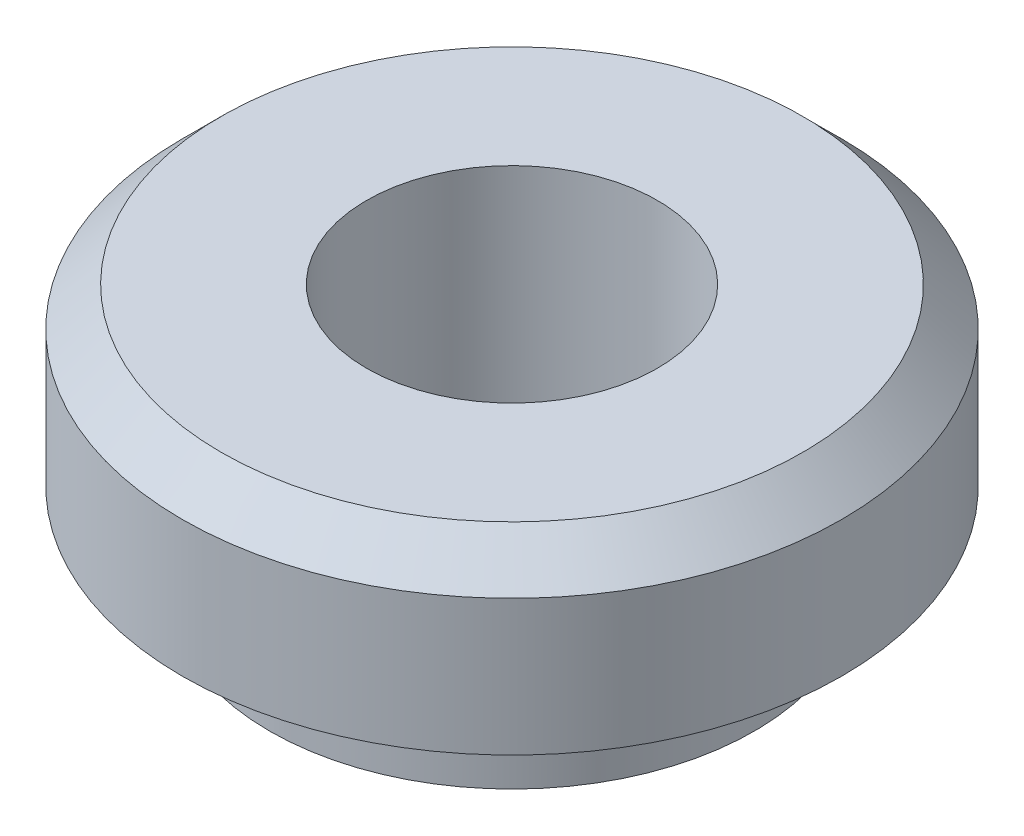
ISO-10303-21;
HEADER;
FILE_DESCRIPTION(('STEP AP214'),'2;1');
FILE_NAME('part.step','',(''),(''),'','','');
FILE_SCHEMA(('AUTOMOTIVE_DESIGN { 1 0 10303 214 1 1 1 1 }'));
ENDSEC;
DATA;
#1=APPLICATION_CONTEXT('core data for automotive mechanical design processes');
#2=APPLICATION_PROTOCOL_DEFINITION('international standard','automotive_design',2000,#1);
#3=PRODUCT_CONTEXT('',#1,'mechanical');
#4=PRODUCT('Part','Part','',(#3));
#5=PRODUCT_RELATED_PRODUCT_CATEGORY('part','',(#4));
#6=PRODUCT_DEFINITION_FORMATION('','',#4);
#7=PRODUCT_DEFINITION_CONTEXT('part definition',#1,'design');
#8=PRODUCT_DEFINITION('design','',#6,#7);
#9=PRODUCT_DEFINITION_SHAPE('','',#8);
#10=(LENGTH_UNIT() NAMED_UNIT(*) SI_UNIT(.MILLI.,.METRE.));
#11=(NAMED_UNIT(*) PLANE_ANGLE_UNIT() SI_UNIT($,.RADIAN.));
#12=(NAMED_UNIT(*) SI_UNIT($,.STERADIAN.) SOLID_ANGLE_UNIT());
#13=UNCERTAINTY_MEASURE_WITH_UNIT(LENGTH_MEASURE(1.E-05),#10,'distance_accuracy_value','');
#14=(GEOMETRIC_REPRESENTATION_CONTEXT(3) GLOBAL_UNCERTAINTY_ASSIGNED_CONTEXT((#13)) GLOBAL_UNIT_ASSIGNED_CONTEXT((#10,
#11,#12)) REPRESENTATION_CONTEXT('',''));
#15=CARTESIAN_POINT('',(0.,0.,0.));
#16=DIRECTION('',(0.,0.,1.));
#17=DIRECTION('',(1.,0.,0.));
#18=AXIS2_PLACEMENT_3D('',#15,#16,#17);
#19=CARTESIAN_POINT('',(0.,-1.1938,-3.175));
#20=DIRECTION('',(0.,-1.,0.));
#21=DIRECTION('',(0.,0.,-1.));
#22=AXIS2_PLACEMENT_3D('',#19,#20,#21);
#23=PLANE('',#22);
#24=CARTESIAN_POINT('',(0.,-1.1938,0.));
#25=DIRECTION('',(0.,1.,0.));
#26=DIRECTION('',(0.,0.,1.));
#27=AXIS2_PLACEMENT_3D('',#24,#25,#26);
#28=CIRCLE('',#27,1.905);
#29=CARTESIAN_POINT('',(0.,-1.1938,1.905));
#30=VERTEX_POINT('',#29);
#31=EDGE_CURVE('E59',#30,#30,#28,.T.);
#32=ORIENTED_EDGE('',*,*,#31,.T.);
#33=EDGE_LOOP('',(#32));
#34=FACE_BOUND('',#33,.T.);
#35=CARTESIAN_POINT('',(0.,-1.1938,0.));
#36=DIRECTION('',(0.,1.,0.));
#37=DIRECTION('',(0.,0.,1.));
#38=AXIS2_PLACEMENT_3D('',#35,#36,#37);
#39=CIRCLE('',#38,3.175);
#40=CARTESIAN_POINT('',(0.,-1.1938,3.175));
#41=VERTEX_POINT('',#40);
#42=EDGE_CURVE('E10',#41,#41,#39,.T.);
#43=ORIENTED_EDGE('',*,*,#42,.F.);
#44=EDGE_LOOP('',(#43));
#45=FACE_BOUND('',#44,.T.);
#46=ADVANCED_FACE('F34',(#34,#45),#23,.T.);
#47=CARTESIAN_POINT('',(0.,5.08,0.));
#48=DIRECTION('',(0.,1.,0.));
#49=DIRECTION('',(0.,0.,1.));
#50=AXIS2_PLACEMENT_3D('',#47,#48,#49);
#51=CYLINDRICAL_SURFACE('',#50,3.175);
#52=ORIENTED_EDGE('',*,*,#42,.T.);
#53=EDGE_LOOP('',(#52));
#54=FACE_BOUND('',#53,.T.);
#55=CARTESIAN_POINT('',(0.,0.,0.));
#56=DIRECTION('',(0.,1.,0.));
#57=DIRECTION('',(0.,0.,1.));
#58=AXIS2_PLACEMENT_3D('',#55,#56,#57);
#59=CIRCLE('',#58,3.175);
#60=CARTESIAN_POINT('',(0.,0.,3.175));
#61=VERTEX_POINT('',#60);
#62=EDGE_CURVE('E40',#61,#61,#59,.T.);
#63=ORIENTED_EDGE('',*,*,#62,.F.);
#64=EDGE_LOOP('',(#63));
#65=FACE_BOUND('',#64,.T.);
#66=ADVANCED_FACE('F77',(#54,#65),#51,.T.);
#67=CARTESIAN_POINT('',(0.,0.,-4.318));
#68=DIRECTION('',(0.,-1.,0.));
#69=DIRECTION('',(0.,0.,-1.));
#70=AXIS2_PLACEMENT_3D('',#67,#68,#69);
#71=PLANE('',#70);
#72=ORIENTED_EDGE('',*,*,#62,.T.);
#73=EDGE_LOOP('',(#72));
#74=FACE_BOUND('',#73,.T.);
#75=CARTESIAN_POINT('',(0.,0.,0.));
#76=DIRECTION('',(0.,1.,0.));
#77=DIRECTION('',(0.,0.,1.));
#78=AXIS2_PLACEMENT_3D('',#75,#76,#77);
#79=CIRCLE('',#78,4.318);
#80=CARTESIAN_POINT('',(0.,0.,4.318));
#81=VERTEX_POINT('',#80);
#82=EDGE_CURVE('E44',#81,#81,#79,.T.);
#83=ORIENTED_EDGE('',*,*,#82,.F.);
#84=EDGE_LOOP('',(#83));
#85=FACE_BOUND('',#84,.T.);
#86=ADVANCED_FACE('F81',(#74,#85),#71,.T.);
#87=CARTESIAN_POINT('',(0.,5.08,0.));
#88=DIRECTION('',(0.,1.,0.));
#89=DIRECTION('',(0.,0.,1.));
#90=AXIS2_PLACEMENT_3D('',#87,#88,#89);
#91=CYLINDRICAL_SURFACE('',#90,4.318);
#92=ORIENTED_EDGE('',*,*,#82,.T.);
#93=EDGE_LOOP('',(#92));
#94=FACE_BOUND('',#93,.T.);
#95=CARTESIAN_POINT('',(0.,1.778,0.));
#96=DIRECTION('',(0.,1.,0.));
#97=DIRECTION('',(0.,0.,1.));
#98=AXIS2_PLACEMENT_3D('',#95,#96,#97);
#99=CIRCLE('',#98,4.318);
#100=CARTESIAN_POINT('',(0.,1.778,4.318));
#101=VERTEX_POINT('',#100);
#102=EDGE_CURVE('E48',#101,#101,#99,.T.);
#103=ORIENTED_EDGE('',*,*,#102,.F.);
#104=EDGE_LOOP('',(#103));
#105=FACE_BOUND('',#104,.T.);
#106=ADVANCED_FACE('F85',(#94,#105),#91,.T.);
#107=CARTESIAN_POINT('',(0.,2.286,0.));
#108=DIRECTION('',(0.,-1.,0.));
#109=DIRECTION('',(0.,0.,-1.));
#110=AXIS2_PLACEMENT_3D('',#107,#108,#109);
#111=CONICAL_SURFACE('',#110,3.81,0.785398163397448);
#112=ORIENTED_EDGE('',*,*,#102,.T.);
#113=EDGE_LOOP('',(#112));
#114=FACE_BOUND('',#113,.T.);
#115=CARTESIAN_POINT('',(0.,2.286,0.));
#116=DIRECTION('',(0.,1.,0.));
#117=DIRECTION('',(0.,0.,1.));
#118=AXIS2_PLACEMENT_3D('',#115,#116,#117);
#119=CIRCLE('',#118,3.81);
#120=CARTESIAN_POINT('',(0.,2.286,3.81));
#121=VERTEX_POINT('',#120);
#122=EDGE_CURVE('E53',#121,#121,#119,.T.);
#123=ORIENTED_EDGE('',*,*,#122,.F.);
#124=EDGE_LOOP('',(#123));
#125=FACE_BOUND('',#124,.T.);
#126=ADVANCED_FACE('F73',(#114,#125),#111,.T.);
#127=CARTESIAN_POINT('',(0.,2.286,-1.905));
#128=DIRECTION('',(0.,1.,0.));
#129=DIRECTION('',(0.,0.,1.));
#130=AXIS2_PLACEMENT_3D('',#127,#128,#129);
#131=PLANE('',#130);
#132=ORIENTED_EDGE('',*,*,#122,.T.);
#133=EDGE_LOOP('',(#132));
#134=FACE_BOUND('',#133,.T.);
#135=CARTESIAN_POINT('',(0.,2.286,0.));
#136=DIRECTION('',(0.,1.,0.));
#137=DIRECTION('',(0.,0.,1.));
#138=AXIS2_PLACEMENT_3D('',#135,#136,#137);
#139=CIRCLE('',#138,1.905);
#140=CARTESIAN_POINT('',(0.,2.286,1.905));
#141=VERTEX_POINT('',#140);
#142=EDGE_CURVE('E56',#141,#141,#139,.T.);
#143=ORIENTED_EDGE('',*,*,#142,.F.);
#144=EDGE_LOOP('',(#143));
#145=FACE_BOUND('',#144,.T.);
#146=ADVANCED_FACE('F67',(#134,#145),#131,.T.);
#147=CARTESIAN_POINT('',(0.,5.08,0.));
#148=DIRECTION('',(0.,1.,0.));
#149=DIRECTION('',(0.,0.,1.));
#150=AXIS2_PLACEMENT_3D('',#147,#148,#149);
#151=CYLINDRICAL_SURFACE('',#150,1.905);
#152=ORIENTED_EDGE('',*,*,#142,.T.);
#153=EDGE_LOOP('',(#152));
#154=FACE_BOUND('',#153,.T.);
#155=ORIENTED_EDGE('',*,*,#31,.F.);
#156=EDGE_LOOP('',(#155));
#157=FACE_BOUND('',#156,.T.);
#158=ADVANCED_FACE('F65',(#154,#157),#151,.F.);
#159=CLOSED_SHELL('',(#46,#66,#86,#106,#126,#146,#158));
#160=MANIFOLD_SOLID_BREP('B2',#159);
#161=ADVANCED_BREP_SHAPE_REPRESENTATION('',(#18,#160),#14);
#162=SHAPE_DEFINITION_REPRESENTATION(#9,#161);
ENDSEC;
END-ISO-10303-21;
